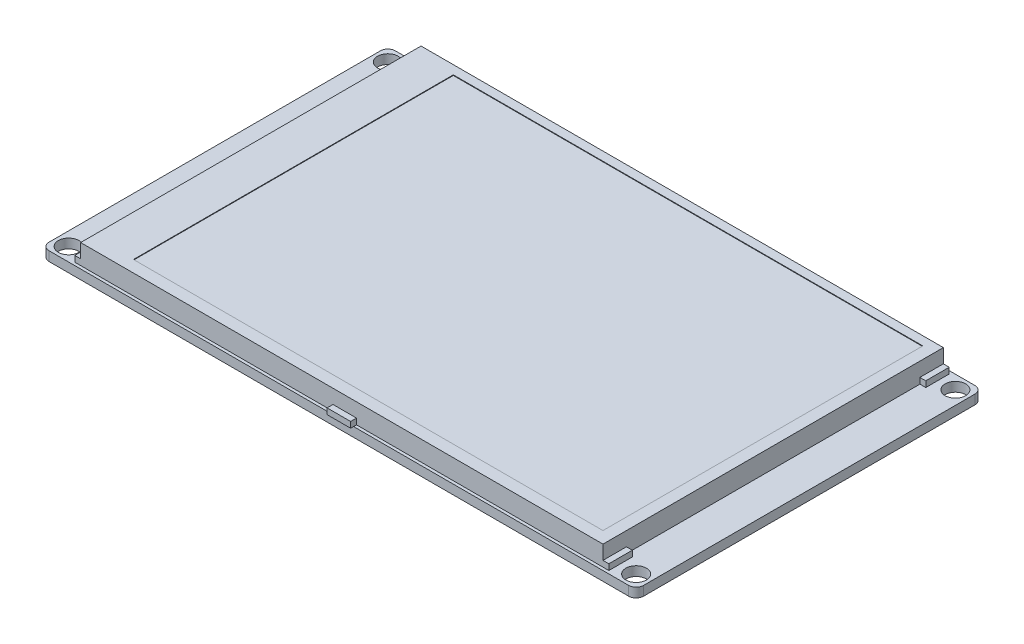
from build123d import *

# Parameters (mm, degrees)
SKETCH_1_R          = 1.75
SKETCH_1_W          = 89
SKETCH_1_H          = 58
SKETCH_1_W_2        = 1
SKETCH_1_H_2        = 4
SKETCH_1_W_3        = 80
SKETCH_1_H_3        = 54.5
SKETCH_1_W_4        = 4
SKETCH_1_H_4        = 0.5
EXTRUDE_1_DEPTH     = 1.6
SKETCH_1_3_W        = 89
SKETCH_1_3_H        = 58
SKETCH_1_3_W_2      = 80
SKETCH_1_3_H_2      = 54.5
EXTRUDE_2_DEPTH     = 5
EXTRUDE_START       = 1.6
SKETCH_1_4_W        = 4
SKETCH_1_4_H        = 1
SKETCH_1_4_W_2      = 1
SKETCH_1_4_H_2      = 4
EXTRUDE_3_DEPTH     = 1
CUT_EXTRUDE_START   = 5
SKETCH_1_5_W        = 80
SKETCH_1_5_H        = 54.5
CUT_EXTRUDE_1_DEPTH = 0.1


with BuildPart() as part:
    # Sketch 1 → Extrude 1 (new body)
    # profile 1 of 10: a face of its own
    with BuildSketch(Plane(origin=(0, 0, 0), x_dir=(1, 0, 0), z_dir=(0, 1, 0))):
        with BuildLine():
            Line((-49.38, -29.5), (49.38, -29.5))
            ThreePointArc((49.38, -29.5), (50.278025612, -29.128025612), (50.65, -28.23))
            Line((50.65, -28.23), (50.65, 28.23))
            ThreePointArc((50.65, 28.23), (50.278025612, 29.128025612), (49.38, 29.5))
            Line((49.38, 29.5), (-49.38, 29.5))
            ThreePointArc((-49.38, 29.5), (-50.278025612, 29.128025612), (-50.65, 28.23))
            Line((-50.65, 28.23), (-50.65, -28.23))
            ThreePointArc((-50.65, -28.23), (-50.278025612, -29.128025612), (-49.38, -29.5))
        make_face()
        with Locations(Location((48.35, 27.2, 0), (0, 0, 270))):
            Circle(SKETCH_1_R, mode=Mode.SUBTRACT)
        with Locations(Location((48.35, -27.2, 0), (0, 0, 270))):
            Circle(SKETCH_1_R, mode=Mode.SUBTRACT)
        with Locations(Location((-48.35, -27.2, 0), (0, 0, 270))):
            Circle(SKETCH_1_R, mode=Mode.SUBTRACT)
        with Locations(Location((-48.35, 27.2, 0), (0, 0, 270))):
            Circle(SKETCH_1_R, mode=Mode.SUBTRACT)
        Rectangle(SKETCH_1_W, SKETCH_1_H, mode=Mode.SUBTRACT)
    # profile 2 of 10: a face of its own
    with BuildSketch(Plane(origin=(0, 0, 0), x_dir=(1, 0, 0), z_dir=(0, 1, 0))):
        Rectangle(SKETCH_1_W, SKETCH_1_H)
    # profile 3 of 10: a face of its own
    with BuildSketch(Plane(origin=(0, 0, 0), x_dir=(1, 0, 0), z_dir=(0, 1, 0))):
        with Locations((-45, -27)):
            Rectangle(SKETCH_1_W_2, SKETCH_1_H_2)
    # profile 4 of 10: a face of its own
    with BuildSketch(Plane(origin=(0, 0, 0), x_dir=(1, 0, 0), z_dir=(0, 1, 0))):
        with Locations((-45, 27)):
            Rectangle(SKETCH_1_W_2, SKETCH_1_H_2)
    # profile 5 of 10: a face of its own
    with BuildSketch(Plane(origin=(0, 0, 0), x_dir=(1, 0, 0), z_dir=(0, 1, 0))):
        with Locations((45, -27)):
            Rectangle(SKETCH_1_W_2, SKETCH_1_H_2)
    # profile 6 of 10: a face of its own
    with BuildSketch(Plane(origin=(0, 0, 0), x_dir=(1, 0, 0), z_dir=(0, 1, 0))):
        with Locations((45, 27)):
            Rectangle(SKETCH_1_W_2, SKETCH_1_H_2)
    # profile 7 of 10: a face of its own
    with BuildSketch(Plane(origin=(0, 0, 0), x_dir=(1, 0, 0), z_dir=(0, 1, 0))):
        with BuildLine():
            Line((49.38, 29.5), (2.5, 29.5))
            Line((2.5, 29.5), (2.5, 29))
            Line((2.5, 29), (44.5, 29))
            Line((44.5, 29), (45.5, 29))
            Line((45.5, 29), (45.5, 25))
            Line((45.5, 25), (44.5, 25))
            Line((44.5, 25), (44.5, -25))
            Line((44.5, -25), (45.5, -25))
            Line((45.5, -25), (45.5, -29))
            Line((45.5, -29), (44.5, -29))
            Line((44.5, -29), (2.5, -29))
            Line((2.5, -29), (2.5, -29.5))
            Line((2.5, -29.5), (49.38, -29.5))
            ThreePointArc((49.38, -29.5), (50.278025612, -29.128025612), (50.65, -28.23))
            Line((50.65, -28.23), (50.65, 28.23))
            ThreePointArc((50.65, 28.23), (50.278025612, 29.128025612), (49.38, 29.5))
        make_face()
        with Locations(Location((48.35, -27.2, 0), (0, 0, 270))):
            Circle(SKETCH_1_R, mode=Mode.SUBTRACT)
        with Locations(Location((48.35, 27.2, 0), (0, 0, 270))):
            Circle(SKETCH_1_R, mode=Mode.SUBTRACT)
    # profile 8 of 10: a face of its own
    with BuildSketch(Plane(origin=(0, 0, 0), x_dir=(1, 0, 0), z_dir=(0, 1, 0))):
        with Locations((2.5, 0.25)):
            Rectangle(SKETCH_1_W_3, SKETCH_1_H_3)
    # profile 9 of 10: a face of its own
    with BuildSketch(Plane(origin=(0, 0, 0), x_dir=(1, 0, 0), z_dir=(0, 1, 0))):
        with Locations((0.5, 29.25)):
            Rectangle(SKETCH_1_W_4, SKETCH_1_H_4)
    # profile 10 of 10: a face of its own
    with BuildSketch(Plane(origin=(0, 0, 0), x_dir=(1, 0, 0), z_dir=(0, 1, 0))):
        with Locations((0.5, -29.25)):
            Rectangle(SKETCH_1_W_4, SKETCH_1_H_4)
    extrude(amount=EXTRUDE_1_DEPTH)

    # Sketch 1_3 → Extrude 2 (add)
    with BuildSketch(Plane(origin=(0, 0, 0), x_dir=(1, 0, 0), z_dir=(0, 1, 0))):
        Rectangle(SKETCH_1_3_W, SKETCH_1_3_H)
        with Locations((2.5, 0.25)):
            Rectangle(SKETCH_1_3_W_2, SKETCH_1_3_H_2)
    extrude(amount=EXTRUDE_2_DEPTH)

    # Sketch 1_4 → Extrude 3 (add)
    with BuildSketch(Plane(origin=(0, 0, 0), x_dir=(1, 0, 0), z_dir=(0, 1, 0)).offset(EXTRUDE_START)):
        with Locations((0.5, 29.5)):
            Rectangle(SKETCH_1_4_W, SKETCH_1_4_H)
        with Locations((-45, 27)):
            Rectangle(SKETCH_1_4_W_2, SKETCH_1_4_H_2)
        with Locations((45, 27)):
            Rectangle(SKETCH_1_4_W_2, SKETCH_1_4_H_2)
        with Locations((0.5, -29.5)):
            Rectangle(SKETCH_1_4_W, SKETCH_1_4_H)
        with Locations((-45, -27)):
            Rectangle(SKETCH_1_4_W_2, SKETCH_1_4_H_2)
        with Locations((45, -27)):
            Rectangle(SKETCH_1_4_W_2, SKETCH_1_4_H_2)
    extrude(amount=EXTRUDE_3_DEPTH)

    # Sketch 1_5 → Cut-Extrude 1 (cut)
    with BuildSketch(Plane(origin=(0, 0, 0), x_dir=(1, 0, 0), z_dir=(0, 1, 0)).offset(CUT_EXTRUDE_START)):
        with Locations((2.5, 0.25)):
            Rectangle(SKETCH_1_5_W, SKETCH_1_5_H)
    extrude(amount=-CUT_EXTRUDE_1_DEPTH, mode=Mode.SUBTRACT)


solid = part.part
